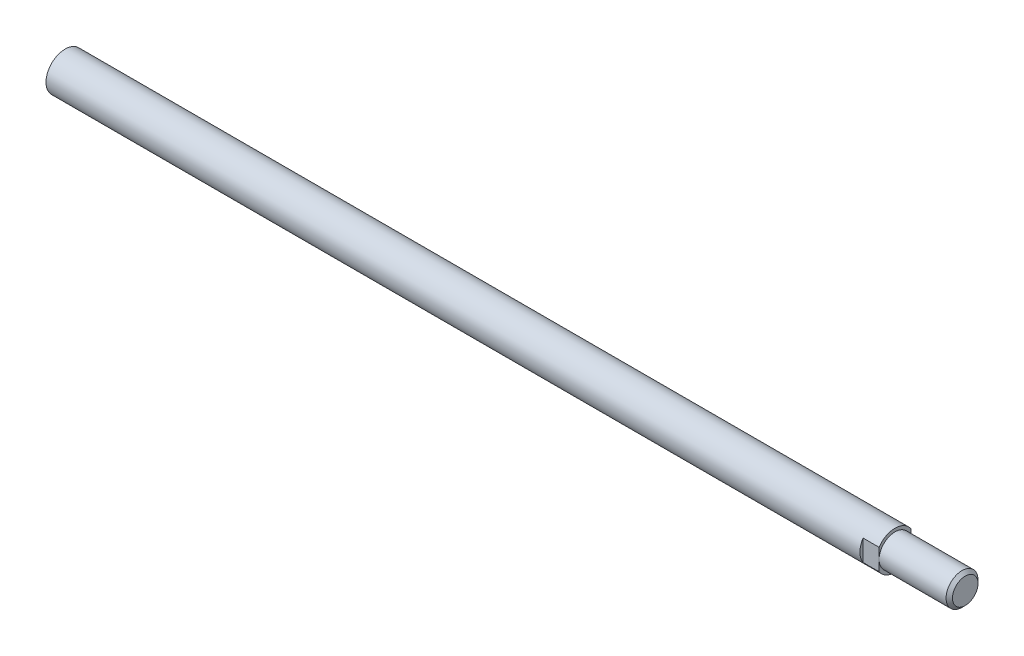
from build123d import *

# Parameters (mm, degrees)
FASE1_SIZE                      = 1
SKIZZE2_W                       = 5
SKIZZE2_H                       = 1
SCHNITT_LINEAR_AUSTRAGEN1_DEPTH = 6


with BuildPart() as part:
    # Skizze1 → Rotation1 (revolve)
    with BuildSketch(Plane.XY):
        Polygon((0, 0), (-260, 0), (-260, 6), (0, 6), (0, 5), (22, 5), (22, 0), align=None)
    revolve(axis=Axis((25.532933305, 0, 0), (-1, 0, 0)))

    # Fase1
    fase1_edges = [part.edges().sort_by_distance(p)[0] for p in [
        (22, -5, 0),
    ]]
    chamfer(fase1_edges, length=FASE1_SIZE)

    # Skizze2 → Schnitt-Linear austragen1 (cut, symmetric)
    with BuildSketch(Plane(origin=(0, 0, 0), x_dir=(-1, 0, 0), z_dir=(0, 1, 0))):
        with Locations((2.5, -5.5)):
            Rectangle(SKIZZE2_W, SKIZZE2_H)
        with Locations((2.5, 5.5)):
            Rectangle(SKIZZE2_W, SKIZZE2_H)
    extrude(amount=SCHNITT_LINEAR_AUSTRAGEN1_DEPTH, both=True, mode=Mode.SUBTRACT)


solid = part.part
